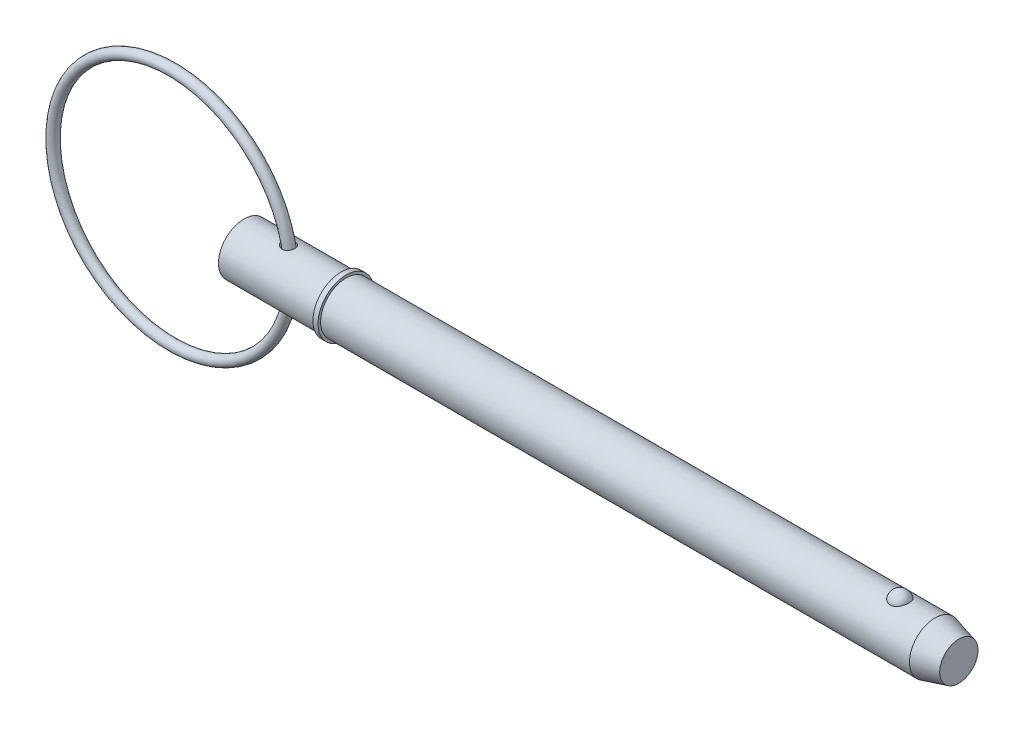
ISO-10303-21;
HEADER;
FILE_DESCRIPTION(('STEP AP214'),'2;1');
FILE_NAME('part.step','',(''),(''),'','','');
FILE_SCHEMA(('AUTOMOTIVE_DESIGN { 1 0 10303 214 1 1 1 1 }'));
ENDSEC;
DATA;
#1=APPLICATION_CONTEXT('core data for automotive mechanical design processes');
#2=APPLICATION_PROTOCOL_DEFINITION('international standard','automotive_design',2000,#1);
#3=PRODUCT_CONTEXT('',#1,'mechanical');
#4=PRODUCT('Part','Part','',(#3));
#5=PRODUCT_RELATED_PRODUCT_CATEGORY('part','',(#4));
#6=PRODUCT_DEFINITION_FORMATION('','',#4);
#7=PRODUCT_DEFINITION_CONTEXT('part definition',#1,'design');
#8=PRODUCT_DEFINITION('design','',#6,#7);
#9=PRODUCT_DEFINITION_SHAPE('','',#8);
#10=(LENGTH_UNIT() NAMED_UNIT(*) SI_UNIT(.MILLI.,.METRE.));
#11=(NAMED_UNIT(*) PLANE_ANGLE_UNIT() SI_UNIT($,.RADIAN.));
#12=(NAMED_UNIT(*) SI_UNIT($,.STERADIAN.) SOLID_ANGLE_UNIT());
#13=UNCERTAINTY_MEASURE_WITH_UNIT(LENGTH_MEASURE(1.E-05),#10,'distance_accuracy_value','');
#14=(GEOMETRIC_REPRESENTATION_CONTEXT(3) GLOBAL_UNCERTAINTY_ASSIGNED_CONTEXT((#13)) GLOBAL_UNIT_ASSIGNED_CONTEXT((#10,
#11,#12)) REPRESENTATION_CONTEXT('',''));
#15=CARTESIAN_POINT('',(0.,0.,0.));
#16=DIRECTION('',(0.,0.,1.));
#17=DIRECTION('',(1.,0.,0.));
#18=AXIS2_PLACEMENT_3D('',#15,#16,#17);
#19=CARTESIAN_POINT('',(-13.4013067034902,0.,0.));
#20=DIRECTION('',(0.,0.,1.));
#21=DIRECTION('',(1.,0.,0.));
#22=AXIS2_PLACEMENT_3D('',#19,#20,#21);
#23=TOROIDAL_SURFACE('',#22,22.225,0.952999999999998);
#24=CARTESIAN_POINT('',(9.77669329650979,0.,0.));
#25=VERTEX_POINT('',#24);
#26=VERTEX_LOOP('',#25);
#27=FACE_BOUND('',#26,.T.);
#28=ADVANCED_FACE('P0_F12',(#27),#23,.T.);
#29=CLOSED_SHELL('',(#28));
#30=MANIFOLD_SOLID_BREP('P0_B1',#29);
#31=CARTESIAN_POINT('',(0.,0.,0.));
#32=DIRECTION('',(1.,0.,0.));
#33=DIRECTION('',(0.,0.,-1.));
#34=AXIS2_PLACEMENT_3D('',#31,#32,#33);
#35=CYLINDRICAL_SURFACE('',#34,4.765);
#36=CARTESIAN_POINT('',(7.31773584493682,4.71580709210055,-0.682926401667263));
#37=CARTESIAN_POINT('',(7.3607471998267,4.70750812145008,-0.740230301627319));
#38=CARTESIAN_POINT('',(7.40883112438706,4.69869300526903,-0.79371122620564));
#39=CARTESIAN_POINT('',(7.51340999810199,4.68106981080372,-0.89180043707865));
#40=CARTESIAN_POINT('',(7.56991882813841,4.67226176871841,-0.936393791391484));
#41=CARTESIAN_POINT('',(7.689548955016,4.65568581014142,-1.01560363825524));
#42=CARTESIAN_POINT('',(7.75265928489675,4.64791621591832,-1.05023633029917));
#43=CARTESIAN_POINT('',(7.88387110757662,4.6343185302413,-1.10870278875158));
#44=CARTESIAN_POINT('',(7.95197058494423,4.62848966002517,-1.13254088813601));
#45=CARTESIAN_POINT('',(8.09209413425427,4.6194749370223,-1.16877415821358));
#46=CARTESIAN_POINT('',(8.16415141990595,4.6163169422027,-1.18104886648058));
#47=CARTESIAN_POINT('',(8.30937958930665,4.61324608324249,-1.19299123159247));
#48=CARTESIAN_POINT('',(8.38255011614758,4.61333220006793,-1.19266284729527));
#49=CARTESIAN_POINT('',(8.52374186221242,4.61674026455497,-1.17939593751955));
#50=CARTESIAN_POINT('',(8.59183022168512,4.61989017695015,-1.16712781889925));
#51=CARTESIAN_POINT('',(8.72470143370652,4.62884731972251,-1.13107903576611));
#52=CARTESIAN_POINT('',(8.78948513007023,4.63465386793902,-1.10730132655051));
#53=CARTESIAN_POINT('',(8.91088768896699,4.64792402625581,-1.05016249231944));
#54=CARTESIAN_POINT('',(8.96774302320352,4.65530108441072,-1.01728198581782));
#55=CARTESIAN_POINT('',(9.07499804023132,4.67102002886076,-0.942471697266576));
#56=CARTESIAN_POINT('',(9.12539777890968,4.6793619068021,-0.900541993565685));
#57=CARTESIAN_POINT('',(9.21836221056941,4.69607497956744,-0.808868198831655));
#58=CARTESIAN_POINT('',(9.26093651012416,4.70444612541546,-0.759133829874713));
#59=CARTESIAN_POINT('',(9.33728390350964,4.72032100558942,-0.653192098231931));
#60=CARTESIAN_POINT('',(9.3710564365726,4.72782468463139,-0.596984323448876));
#61=CARTESIAN_POINT('',(9.42940600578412,4.74126034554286,-0.478808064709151));
#62=CARTESIAN_POINT('',(9.45384681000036,4.74716869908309,-0.416769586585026));
#63=CARTESIAN_POINT('',(9.49226260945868,4.75663465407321,-0.289362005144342));
#64=CARTESIAN_POINT('',(9.50623742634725,4.76019221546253,-0.22399284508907));
#65=CARTESIAN_POINT('',(9.52342004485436,4.76458450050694,-0.0914886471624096));
#66=CARTESIAN_POINT('',(9.52658321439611,4.7654079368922,-0.0243474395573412));
#67=CARTESIAN_POINT('',(9.52194012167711,4.76421136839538,0.109528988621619));
#68=CARTESIAN_POINT('',(9.51413380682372,4.7621913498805,0.176264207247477));
#69=CARTESIAN_POINT('',(9.48775485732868,4.75552896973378,0.307367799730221));
#70=CARTESIAN_POINT('',(9.4691926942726,4.75088915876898,0.371738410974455));
#71=CARTESIAN_POINT('',(9.42175836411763,4.73949008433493,0.496364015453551));
#72=CARTESIAN_POINT('',(9.39288586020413,4.73273075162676,0.556618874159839));
#73=CARTESIAN_POINT('',(9.32549385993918,4.71782154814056,0.671371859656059));
#74=CARTESIAN_POINT('',(9.28696367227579,4.70967013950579,0.725863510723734));
#75=CARTESIAN_POINT('',(9.20123305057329,4.6928883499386,0.827453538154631));
#76=CARTESIAN_POINT('',(9.15403300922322,4.68425799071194,0.874552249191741));
#77=CARTESIAN_POINT('',(9.05250467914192,4.66754854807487,0.959736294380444));
#78=CARTESIAN_POINT('',(8.99822095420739,4.65946646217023,0.997874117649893));
#79=CARTESIAN_POINT('',(8.88381123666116,4.64472049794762,1.06440739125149));
#80=CARTESIAN_POINT('',(8.82368614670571,4.63805640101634,1.09280434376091));
#81=CARTESIAN_POINT('',(8.70022952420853,4.62698068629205,1.13878427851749));
#82=CARTESIAN_POINT('',(8.63695594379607,4.62253830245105,1.15651569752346));
#83=CARTESIAN_POINT('',(8.50825296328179,4.61622454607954,1.18146656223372));
#84=CARTESIAN_POINT('',(8.44282353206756,4.61435321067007,1.18868585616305));
#85=CARTESIAN_POINT('',(8.31119087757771,4.61332122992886,1.19268442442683));
#86=CARTESIAN_POINT('',(8.24498542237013,4.61417920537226,1.18939198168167));
#87=CARTESIAN_POINT('',(8.11397487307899,4.61847671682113,1.17259121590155));
#88=CARTESIAN_POINT('',(8.04917011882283,4.62191687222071,1.15908044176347));
#89=CARTESIAN_POINT('',(7.91946226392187,4.63117528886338,1.12153047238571));
#90=CARTESIAN_POINT('',(7.85470460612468,4.6371000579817,1.09701575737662));
#91=CARTESIAN_POINT('',(7.7300035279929,4.65063246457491,1.03814807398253));
#92=CARTESIAN_POINT('',(7.67006197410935,4.65824075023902,1.00379131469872));
#93=CARTESIAN_POINT('',(7.55352765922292,4.67473656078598,0.924015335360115));
#94=CARTESIAN_POINT('',(7.49726947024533,4.68366994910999,0.878115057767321));
#95=CARTESIAN_POINT('',(7.39344083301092,4.70144936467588,0.777311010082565));
#96=CARTESIAN_POINT('',(7.34587087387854,4.71029538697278,0.722406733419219));
#97=CARTESIAN_POINT('',(7.26188955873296,4.72669773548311,0.605773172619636));
#98=CARTESIAN_POINT('',(7.22531316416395,4.73427229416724,0.544165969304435));
#99=CARTESIAN_POINT('',(7.16406269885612,4.74732663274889,0.415095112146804));
#100=CARTESIAN_POINT('',(7.13937848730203,4.75280819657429,0.347636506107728));
#101=CARTESIAN_POINT('',(7.10494917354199,4.7605495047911,0.215359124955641));
#102=CARTESIAN_POINT('',(7.09405441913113,4.76305589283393,0.150853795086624));
#103=CARTESIAN_POINT('',(7.08387189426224,4.76539656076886,0.0208839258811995));
#104=CARTESIAN_POINT('',(7.0845805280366,4.76523166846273,-0.0445803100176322));
#105=CARTESIAN_POINT('',(7.09709111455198,4.76236014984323,-0.169693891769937));
#106=CARTESIAN_POINT('',(7.10810913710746,4.75983315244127,-0.229428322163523));
#107=CARTESIAN_POINT('',(7.13959099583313,4.75276726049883,-0.346187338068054));
#108=CARTESIAN_POINT('',(7.16004881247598,4.7482296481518,-0.403213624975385));
#109=CARTESIAN_POINT('',(7.20270325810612,4.73907067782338,-0.498040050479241));
#110=CARTESIAN_POINT('',(7.22286864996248,4.73481668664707,-0.536809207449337));
#111=CARTESIAN_POINT('',(7.26730952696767,4.72570777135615,-0.611832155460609));
#112=CARTESIAN_POINT('',(7.29158512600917,4.72085283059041,-0.64808587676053));
#113=CARTESIAN_POINT('',(7.31773584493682,4.71580709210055,-0.682926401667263));
#114=B_SPLINE_CURVE_WITH_KNOTS('',3,(#36,#37,#38,#39,#40,#41,#42,#43,#44,#45,#46,#47,#48,#49,
#50,#51,#52,#53,#54,#55,#56,#57,#58,#59,#60,#61,#62,#63,#64,#65,#66,#67,#68,#69,#70,#71,#72,#73,
#74,#75,#76,#77,#78,#79,#80,#81,#82,#83,#84,#85,#86,#87,#88,#89,#90,#91,#92,#93,#94,#95,#96,#97,
#98,#99,#100,#101,#102,#103,#104,#105,#106,#107,#108,#109,#110,#111,#112,#113),.UNSPECIFIED.,
.T.,.F.,(4,2,2,2,2,2,2,2,2,2,2,2,2,2,2,2,2,2,2,2,2,2,2,2,2,2,2,2,2,2,2,2,2,2,2,2,2,2,4),(0.,
0.216219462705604,0.432799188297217,0.649024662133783,0.865163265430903,1.08352938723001,
1.30182691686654,1.50853487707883,1.71518978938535,1.91252381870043,2.1098561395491,
2.30694457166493,2.50404555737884,2.70392296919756,2.90380378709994,3.10450875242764,
3.30521468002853,3.5057255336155,3.70624293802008,3.90698330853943,4.10771458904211,
4.30723900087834,4.50673262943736,4.70338139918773,4.90003300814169,5.09802914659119,
5.29607279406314,5.5036500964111,5.7113074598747,5.92972727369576,6.14815938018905,
6.36312650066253,6.57790998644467,6.77325899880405,6.96854747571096,7.15009726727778,
7.33153144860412,7.46298830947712,7.59444881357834),.UNSPECIFIED.);
#115=CARTESIAN_POINT('',(7.31773584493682,4.71580709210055,-0.682926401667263));
#116=VERTEX_POINT('',#115);
#117=EDGE_CURVE('P1_E42',#116,#116,#114,.T.);
#118=ORIENTED_EDGE('',*,*,#117,.T.);
#119=EDGE_LOOP('',(#118));
#120=FACE_BOUND('',#119,.T.);
#121=CARTESIAN_POINT('',(0.,0.,0.));
#122=DIRECTION('',(1.,0.,0.));
#123=DIRECTION('',(0.,0.,-1.));
#124=AXIS2_PLACEMENT_3D('',#121,#122,#123);
#125=CIRCLE('',#124,4.765);
#126=CARTESIAN_POINT('',(0.,0.,-4.765));
#127=VERTEX_POINT('',#126);
#128=EDGE_CURVE('P1_E9',#127,#127,#125,.T.);
#129=ORIENTED_EDGE('',*,*,#128,.T.);
#130=EDGE_LOOP('',(#129));
#131=FACE_BOUND('',#130,.T.);
#132=CARTESIAN_POINT('',(18.097,0.,0.));
#133=DIRECTION('',(1.,0.,0.));
#134=DIRECTION('',(0.,0.,-1.));
#135=AXIS2_PLACEMENT_3D('',#132,#133,#134);
#136=CIRCLE('',#135,4.765);
#137=CARTESIAN_POINT('',(18.097,0.,-4.765));
#138=VERTEX_POINT('',#137);
#139=EDGE_CURVE('P1_E25',#138,#138,#136,.T.);
#140=ORIENTED_EDGE('',*,*,#139,.F.);
#141=EDGE_LOOP('',(#140));
#142=FACE_BOUND('',#141,.T.);
#143=CARTESIAN_POINT('',(7.31773584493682,-4.71580709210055,-0.682926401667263));
#144=CARTESIAN_POINT('',(7.27956054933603,-4.72317282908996,-0.63206220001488));
#145=CARTESIAN_POINT('',(7.24535712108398,-4.7301361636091,-0.578155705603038));
#146=CARTESIAN_POINT('',(7.18611785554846,-4.74256090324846,-0.465352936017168));
#147=CARTESIAN_POINT('',(7.16107836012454,-4.74802290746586,-0.406458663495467));
#148=CARTESIAN_POINT('',(7.12119149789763,-4.75686558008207,-0.284913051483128));
#149=CARTESIAN_POINT('',(7.1063796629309,-4.76023898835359,-0.222249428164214));
#150=CARTESIAN_POINT('',(7.08786546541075,-4.76447177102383,-0.0952170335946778));
#151=CARTESIAN_POINT('',(7.08416018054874,-4.76533180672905,-0.0308487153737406));
#152=CARTESIAN_POINT('',(7.08795686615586,-4.76445764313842,0.0942755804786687));
#153=CARTESIAN_POINT('',(7.09490366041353,-4.762851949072,0.155050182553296));
#154=CARTESIAN_POINT('',(7.11863973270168,-4.75746086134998,0.2745356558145));
#155=CARTESIAN_POINT('',(7.13542953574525,-4.75367535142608,0.333246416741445));
#156=CARTESIAN_POINT('',(7.17817193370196,-4.74430545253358,0.447305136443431));
#157=CARTESIAN_POINT('',(7.20415836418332,-4.73871442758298,0.502639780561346));
#158=CARTESIAN_POINT('',(7.26428068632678,-4.72628508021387,0.608523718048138));
#159=CARTESIAN_POINT('',(7.29841897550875,-4.71944639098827,0.659071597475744));
#160=CARTESIAN_POINT('',(7.37680984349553,-4.70456239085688,0.758311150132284));
#161=CARTESIAN_POINT('',(7.42165519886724,-4.69646426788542,0.806526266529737));
#162=CARTESIAN_POINT('',(7.51828933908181,-4.68032890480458,0.895428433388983));
#163=CARTESIAN_POINT('',(7.57008134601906,-4.67229169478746,0.936111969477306));
#164=CARTESIAN_POINT('',(7.68397204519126,-4.65640659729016,1.01229731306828));
#165=CARTESIAN_POINT('',(7.74657226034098,-4.64863251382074,1.04706751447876));
#166=CARTESIAN_POINT('',(7.87680110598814,-4.6349740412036,1.10596507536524));
#167=CARTESIAN_POINT('',(7.94443054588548,-4.62908995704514,1.13009071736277));
#168=CARTESIAN_POINT('',(8.08402017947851,-4.61989019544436,1.16713943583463));
#169=CARTESIAN_POINT('',(8.15603143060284,-4.61661596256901,1.17988211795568));
#170=CARTESIAN_POINT('',(8.30124697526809,-4.61330446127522,1.1927680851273));
#171=CARTESIAN_POINT('',(8.37445077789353,-4.61326589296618,1.19291642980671));
#172=CARTESIAN_POINT('',(8.51584800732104,-4.61644036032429,1.18056687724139));
#173=CARTESIAN_POINT('',(8.58410302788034,-4.61948317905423,1.16873099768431));
#174=CARTESIAN_POINT('',(8.71738052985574,-4.6282520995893,1.13350536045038));
#175=CARTESIAN_POINT('',(8.78240382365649,-4.63397752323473,1.11011852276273));
#176=CARTESIAN_POINT('',(8.90428519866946,-4.64711877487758,1.05371003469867));
#177=CARTESIAN_POINT('',(8.96138096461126,-4.6544450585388,1.02117932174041));
#178=CARTESIAN_POINT('',(9.06916653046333,-4.6700970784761,0.947021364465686));
#179=CARTESIAN_POINT('',(9.11985639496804,-4.67842280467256,0.905394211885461));
#180=CARTESIAN_POINT('',(9.2134071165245,-4.69513303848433,0.814300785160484));
#181=CARTESIAN_POINT('',(9.25628268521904,-4.70351740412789,0.764849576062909));
#182=CARTESIAN_POINT('',(9.33327173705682,-4.71945185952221,0.659422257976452));
#183=CARTESIAN_POINT('',(9.3673846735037,-4.72700189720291,0.603445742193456));
#184=CARTESIAN_POINT('',(9.42645214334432,-4.74055953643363,0.485673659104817));
#185=CARTESIAN_POINT('',(9.45127042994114,-4.74654383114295,0.423807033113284));
#186=CARTESIAN_POINT('',(9.49046298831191,-4.756182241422,0.296676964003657));
#187=CARTESIAN_POINT('',(9.50483706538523,-4.75983631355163,0.231413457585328));
#188=CARTESIAN_POINT('',(9.52283408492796,-4.76443282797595,0.0990368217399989));
#189=CARTESIAN_POINT('',(9.52641016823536,-4.76536345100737,0.0319169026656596));
#190=CARTESIAN_POINT('',(9.52259067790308,-4.76437893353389,-0.101988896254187));
#191=CARTESIAN_POINT('',(9.5151950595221,-4.76246378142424,-0.168774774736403));
#192=CARTESIAN_POINT('',(9.48962516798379,-4.75599746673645,-0.300048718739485));
#193=CARTESIAN_POINT('',(9.4714615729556,-4.75144891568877,-0.364538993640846));
#194=CARTESIAN_POINT('',(9.42480303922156,-4.74020887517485,-0.489470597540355));
#195=CARTESIAN_POINT('',(9.396307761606,-4.73351731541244,-0.549911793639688));
#196=CARTESIAN_POINT('',(9.32963953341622,-4.71871240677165,-0.665099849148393));
#197=CARTESIAN_POINT('',(9.29145577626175,-4.71059747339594,-0.719840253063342));
#198=CARTESIAN_POINT('',(9.20637695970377,-4.69385254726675,-0.82198328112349));
#199=CARTESIAN_POINT('',(9.15948227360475,-4.68522257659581,-0.869386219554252));
#200=CARTESIAN_POINT('',(9.05849937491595,-4.66847516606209,-0.955233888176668));
#201=CARTESIAN_POINT('',(9.00445430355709,-4.6603550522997,-0.993728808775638));
#202=CARTESIAN_POINT('',(8.8904576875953,-4.64550122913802,-1.06100691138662));
#203=CARTESIAN_POINT('',(8.83050704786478,-4.63876730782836,-1.08979157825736));
#204=CARTESIAN_POINT('',(8.70732873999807,-4.6275305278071,-1.13655620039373));
#205=CARTESIAN_POINT('',(8.64416019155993,-4.62299714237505,-1.15468477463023));
#206=CARTESIAN_POINT('',(8.51559711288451,-4.61649071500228,-1.18043067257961));
#207=CARTESIAN_POINT('',(8.4502025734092,-4.61451768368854,-1.18804795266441));
#208=CARTESIAN_POINT('',(8.31862013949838,-4.61328355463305,-1.19283094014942));
#209=CARTESIAN_POINT('',(8.25242983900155,-4.61403911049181,-1.18993246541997));
#210=CARTESIAN_POINT('',(8.12138461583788,-4.61814057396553,-1.17391149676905));
#211=CARTESIAN_POINT('',(8.0565300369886,-4.62148714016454,-1.16078640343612));
#212=CARTESIAN_POINT('',(7.92669960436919,-4.63056912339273,-1.12402333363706));
#213=CARTESIAN_POINT('',(7.86186447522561,-4.63641051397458,-1.09991536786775));
#214=CARTESIAN_POINT('',(7.73694230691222,-4.64980121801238,-1.04185298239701));
#215=CARTESIAN_POINT('',(7.6768568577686,-4.65735110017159,-1.0078952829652));
#216=CARTESIAN_POINT('',(7.56207884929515,-4.67346080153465,-0.930364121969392));
#217=CARTESIAN_POINT('',(7.5074784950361,-4.68203382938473,-0.886656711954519));
#218=CARTESIAN_POINT('',(7.40624045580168,-4.69916824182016,-0.79082583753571));
#219=CARTESIAN_POINT('',(7.35959988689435,-4.7077296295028,-0.738705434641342));
#220=CARTESIAN_POINT('',(7.31773584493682,-4.71580709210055,-0.682926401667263));
#221=B_SPLINE_CURVE_WITH_KNOTS('',3,(#143,#144,#145,#146,#147,#148,#149,#150,#151,#152,#153,
#154,#155,#156,#157,#158,#159,#160,#161,#162,#163,#164,#165,#166,#167,#168,#169,#170,#171,#172,
#173,#174,#175,#176,#177,#178,#179,#180,#181,#182,#183,#184,#185,#186,#187,#188,#189,#190,#191,
#192,#193,#194,#195,#196,#197,#198,#199,#200,#201,#202,#203,#204,#205,#206,#207,#208,#209,#210,
#211,#212,#213,#214,#215,#216,#217,#218,#219,#220),.UNSPECIFIED.,.T.,.F.,(4,2,2,2,2,2,2,2,2,2,2,
2,2,2,2,2,2,2,2,2,2,2,2,2,2,2,2,2,2,2,2,2,2,2,2,2,2,2,4),(0.,0.191851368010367,0.38362606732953,
0.576063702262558,0.768450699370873,0.951145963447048,1.13385097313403,1.31723528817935,
1.50067360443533,1.69887079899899,1.8971602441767,2.11225870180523,2.32739185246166,
2.54587681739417,2.76427400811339,2.97123130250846,3.17813630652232,3.37555441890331,
3.57297054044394,3.77001106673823,3.96706388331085,4.16690159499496,4.36674303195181,
4.56745046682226,4.76815872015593,4.96866827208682,5.16918440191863,5.36992517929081,
5.5706573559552,5.77022940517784,5.96977092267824,6.16645904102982,6.36314797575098,
6.56103940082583,6.75898114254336,6.96633026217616,7.17374850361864,7.384214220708,
7.59460352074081),.UNSPECIFIED.);
#222=CARTESIAN_POINT('',(7.31773584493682,-4.71580709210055,-0.682926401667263));
#223=VERTEX_POINT('',#222);
#224=EDGE_CURVE('P1_E17',#223,#223,#221,.T.);
#225=ORIENTED_EDGE('',*,*,#224,.T.);
#226=EDGE_LOOP('',(#225));
#227=FACE_BOUND('',#226,.T.);
#228=ADVANCED_FACE('P1_F13',(#120,#131,#142,#227),#35,.T.);
#229=CARTESIAN_POINT('',(0.,0.,0.));
#230=DIRECTION('',(1.,0.,0.));
#231=DIRECTION('',(0.,0.,-1.));
#232=AXIS2_PLACEMENT_3D('',#229,#230,#231);
#233=CYLINDRICAL_SURFACE('',#232,4.765);
#234=CARTESIAN_POINT('',(128.904194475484,0.,0.));
#235=DIRECTION('',(1.,0.,0.));
#236=DIRECTION('',(0.,0.,-1.));
#237=AXIS2_PLACEMENT_3D('',#234,#235,#236);
#238=CIRCLE('',#237,4.765);
#239=CARTESIAN_POINT('',(128.904194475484,0.,-4.765));
#240=VERTEX_POINT('',#239);
#241=EDGE_CURVE('P1_E99',#240,#240,#238,.T.);
#242=ORIENTED_EDGE('',*,*,#241,.F.);
#243=EDGE_LOOP('',(#242));
#244=FACE_BOUND('',#243,.T.);
#245=CARTESIAN_POINT('',(19.05,0.,0.));
#246=DIRECTION('',(1.,0.,0.));
#247=DIRECTION('',(0.,0.,-1.));
#248=AXIS2_PLACEMENT_3D('',#245,#246,#247);
#249=CIRCLE('',#248,4.765);
#250=CARTESIAN_POINT('',(19.05,0.,-4.765));
#251=VERTEX_POINT('',#250);
#252=EDGE_CURVE('P1_E96',#251,#251,#249,.T.);
#253=ORIENTED_EDGE('',*,*,#252,.T.);
#254=EDGE_LOOP('',(#253));
#255=FACE_BOUND('',#254,.T.);
#256=CARTESIAN_POINT('',(122.351020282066,4.42764777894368,1.76101111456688));
#257=CARTESIAN_POINT('',(122.259721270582,4.42764470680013,1.76101422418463));
#258=CARTESIAN_POINT('',(122.168446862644,4.43059091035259,1.75366340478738));
#259=CARTESIAN_POINT('',(121.988615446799,4.44201846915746,1.72451180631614));
#260=CARTESIAN_POINT('',(121.900057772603,4.45049845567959,1.70271460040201));
#261=CARTESIAN_POINT('',(121.728257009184,4.47200516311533,1.6453937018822));
#262=CARTESIAN_POINT('',(121.645006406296,4.48502527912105,1.60988994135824));
#263=CARTESIAN_POINT('',(121.485763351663,4.51419542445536,1.52617873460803));
#264=CARTESIAN_POINT('',(121.409772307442,4.53034605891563,1.47796883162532));
#265=CARTESIAN_POINT('',(121.264744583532,4.5645931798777,1.36860494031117));
#266=CARTESIAN_POINT('',(121.195964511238,4.58273170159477,1.30712420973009));
#267=CARTESIAN_POINT('',(121.069342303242,4.61870302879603,1.17370204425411));
#268=CARTESIAN_POINT('',(121.011502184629,4.63653577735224,1.10175868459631));
#269=CARTESIAN_POINT('',(120.905570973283,4.67090140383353,0.945806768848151));
#270=CARTESIAN_POINT('',(120.858030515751,4.68734068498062,0.861402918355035));
#271=CARTESIAN_POINT('',(120.777081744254,4.71628466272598,0.685442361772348));
#272=CARTESIAN_POINT('',(120.743674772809,4.72878898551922,0.593884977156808));
#273=CARTESIAN_POINT('',(120.691287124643,4.74874061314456,0.40478128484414));
#274=CARTESIAN_POINT('',(120.672517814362,4.75611366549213,0.307168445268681));
#275=CARTESIAN_POINT('',(120.650584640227,4.76475393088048,0.109940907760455));
#276=CARTESIAN_POINT('',(120.647420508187,4.76602124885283,0.0103262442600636));
#277=CARTESIAN_POINT('',(120.656740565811,4.76232928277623,-0.187629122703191));
#278=CARTESIAN_POINT('',(120.669158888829,4.7573962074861,-0.285973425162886));
#279=CARTESIAN_POINT('',(120.709280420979,4.74184975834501,-0.47902728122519));
#280=CARTESIAN_POINT('',(120.736983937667,4.7312362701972,-0.573736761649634));
#281=CARTESIAN_POINT('',(120.807158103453,4.70540026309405,-0.756973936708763));
#282=CARTESIAN_POINT('',(120.849646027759,4.69017235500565,-0.845494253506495));
#283=CARTESIAN_POINT('',(120.948520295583,4.6566986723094,-1.01378033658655));
#284=CARTESIAN_POINT('',(121.004907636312,4.63845268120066,-1.09354547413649));
#285=CARTESIAN_POINT('',(121.130552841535,4.60085438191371,-1.24228523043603));
#286=CARTESIAN_POINT('',(121.199843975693,4.58149930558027,-1.31123108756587));
#287=CARTESIAN_POINT('',(121.349606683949,4.54391653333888,-1.43607409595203));
#288=CARTESIAN_POINT('',(121.430077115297,4.52568872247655,-1.49197257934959));
#289=CARTESIAN_POINT('',(121.598150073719,4.49293007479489,-1.58786764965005));
#290=CARTESIAN_POINT('',(121.685544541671,4.47832346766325,-1.62820219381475));
#291=CARTESIAN_POINT('',(121.866553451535,4.45406011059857,-1.69345757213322));
#292=CARTESIAN_POINT('',(121.96016555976,4.44440151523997,-1.71838415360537));
#293=CARTESIAN_POINT('',(122.145893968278,4.43159888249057,-1.75112843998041));
#294=CARTESIAN_POINT('',(122.237849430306,4.42815213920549,-1.75974223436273));
#295=CARTESIAN_POINT('',(122.421965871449,4.427247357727,-1.76201865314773));
#296=CARTESIAN_POINT('',(122.514126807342,4.42978816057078,-1.7556841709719));
#297=CARTESIAN_POINT('',(122.693129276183,4.4403864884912,-1.72869560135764));
#298=CARTESIAN_POINT('',(122.780047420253,4.44827555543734,-1.70847853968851));
#299=CARTESIAN_POINT('',(122.949131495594,4.46852246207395,-1.65479562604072));
#300=CARTESIAN_POINT('',(123.031297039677,4.48088066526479,-1.62132869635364));
#301=CARTESIAN_POINT('',(123.190591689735,4.50907357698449,-1.54120560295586));
#302=CARTESIAN_POINT('',(123.267570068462,4.52497884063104,-1.49427526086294));
#303=CARTESIAN_POINT('',(123.412708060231,4.55845148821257,-1.38881222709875));
#304=CARTESIAN_POINT('',(123.480865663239,4.57601924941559,-1.33027689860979));
#305=CARTESIAN_POINT('',(123.610099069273,4.61196537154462,-1.19991049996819));
#306=CARTESIAN_POINT('',(123.670656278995,4.63034074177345,-1.12756415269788));
#307=CARTESIAN_POINT('',(123.779279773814,4.66513959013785,-0.973612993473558));
#308=CARTESIAN_POINT('',(123.827343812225,4.68156271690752,-0.892006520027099));
#309=CARTESIAN_POINT('',(123.911383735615,4.71130224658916,-0.71889227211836));
#310=CARTESIAN_POINT('',(123.946918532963,4.724501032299,-0.627149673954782));
#311=CARTESIAN_POINT('',(124.002952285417,4.74571823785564,-0.438611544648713));
#312=CARTESIAN_POINT('',(124.023450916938,4.75373654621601,-0.341815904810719));
#313=CARTESIAN_POINT('',(124.049033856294,4.76378905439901,-0.145633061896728));
#314=CARTESIAN_POINT('',(124.054076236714,4.76580697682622,-0.0462395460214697));
#315=CARTESIAN_POINT('',(124.048523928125,4.7636057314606,0.152038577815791));
#316=CARTESIAN_POINT('',(124.037929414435,4.75938663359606,0.250923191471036));
#317=CARTESIAN_POINT('',(124.001387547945,4.74516937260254,0.445004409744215));
#318=CARTESIAN_POINT('',(123.975496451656,4.73519238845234,0.540213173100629));
#319=CARTESIAN_POINT('',(123.908927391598,4.71049394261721,0.724662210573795));
#320=CARTESIAN_POINT('',(123.868248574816,4.69577220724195,0.81390214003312));
#321=CARTESIAN_POINT('',(123.772717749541,4.66303767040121,0.984313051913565));
#322=CARTESIAN_POINT('',(123.717804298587,4.64501070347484,1.06544688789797));
#323=CARTESIAN_POINT('',(123.595049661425,4.60764678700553,1.21692673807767));
#324=CARTESIAN_POINT('',(123.527208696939,4.58830985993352,1.2872729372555));
#325=CARTESIAN_POINT('',(123.380548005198,4.55060370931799,1.41479271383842));
#326=CARTESIAN_POINT('',(123.301791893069,4.53222967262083,1.47203785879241));
#327=CARTESIAN_POINT('',(123.134989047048,4.49849576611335,1.57212016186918));
#328=CARTESIAN_POINT('',(123.046941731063,4.48313608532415,1.61495641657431));
#329=CARTESIAN_POINT('',(122.859791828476,4.45676184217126,1.68642657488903));
#330=CARTESIAN_POINT('',(122.760365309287,4.44598302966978,1.71430590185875));
#331=CARTESIAN_POINT('',(122.557621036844,4.43142918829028,1.75159258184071));
#332=CARTESIAN_POINT('',(122.454304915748,4.42765125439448,1.76100759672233));
#333=CARTESIAN_POINT('',(122.351020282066,4.42764777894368,1.76101111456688));
#334=B_SPLINE_CURVE_WITH_KNOTS('',3,(#256,#257,#258,#259,#260,#261,#262,#263,#264,#265,#266,
#267,#268,#269,#270,#271,#272,#273,#274,#275,#276,#277,#278,#279,#280,#281,#282,#283,#284,#285,
#286,#287,#288,#289,#290,#291,#292,#293,#294,#295,#296,#297,#298,#299,#300,#301,#302,#303,#304,
#305,#306,#307,#308,#309,#310,#311,#312,#313,#314,#315,#316,#317,#318,#319,#320,#321,#322,#323,
#324,#325,#326,#327,#328,#329,#330,#331,#332,#333),.UNSPECIFIED.,.T.,.F.,(4,2,2,2,2,2,2,2,2,2,2,
2,2,2,2,2,2,2,2,2,2,2,2,2,2,2,2,2,2,2,2,2,2,2,2,2,2,2,4),(0.,0.273517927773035,
0.546968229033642,0.820022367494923,1.09312934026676,1.37393946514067,1.65480131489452,
1.94820420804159,2.24163496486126,2.53922817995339,2.8368162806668,3.13315071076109,
3.42949110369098,3.72617893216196,4.02288805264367,4.32037303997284,4.61782764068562,
4.90840095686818,5.19886582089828,5.4747485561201,5.75057789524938,6.01809977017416,
6.2856434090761,6.55907787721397,6.83257454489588,7.11962987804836,7.40673679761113,
7.70312663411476,7.99952284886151,8.29672237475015,8.59391856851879,8.89002850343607,
9.18615552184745,9.483582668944,9.78100471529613,10.0767610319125,10.3725358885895,
10.6820893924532,10.991514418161),.UNSPECIFIED.);
#335=CARTESIAN_POINT('',(122.351020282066,4.42764777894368,1.76101111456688));
#336=VERTEX_POINT('',#335);
#337=EDGE_CURVE('P1_E34',#336,#336,#334,.T.);
#338=ORIENTED_EDGE('',*,*,#337,.T.);
#339=EDGE_LOOP('',(#338));
#340=FACE_BOUND('',#339,.T.);
#341=ADVANCED_FACE('P1_F46',(#244,#255,#340),#233,.T.);
#342=CARTESIAN_POINT('',(0.,0.,0.));
#343=DIRECTION('',(-1.,0.,0.));
#344=DIRECTION('',(0.,0.,1.));
#345=AXIS2_PLACEMENT_3D('',#342,#343,#344);
#346=PLANE('',#345);
#347=ORIENTED_EDGE('',*,*,#128,.F.);
#348=EDGE_LOOP('',(#347));
#349=FACE_BOUND('',#348,.T.);
#350=ADVANCED_FACE('P1_F15',(#349),#346,.T.);
#351=CARTESIAN_POINT('',(18.097,4.765,0.));
#352=DIRECTION('',(-1.,0.,0.));
#353=DIRECTION('',(0.,0.,1.));
#354=AXIS2_PLACEMENT_3D('',#351,#352,#353);
#355=PLANE('',#354);
#356=ORIENTED_EDGE('',*,*,#139,.T.);
#357=EDGE_LOOP('',(#356));
#358=FACE_BOUND('',#357,.T.);
#359=CARTESIAN_POINT('',(18.097,0.,0.));
#360=DIRECTION('',(1.,0.,0.));
#361=DIRECTION('',(0.,0.,-1.));
#362=AXIS2_PLACEMENT_3D('',#359,#360,#361);
#363=CIRCLE('',#362,5.2415);
#364=CARTESIAN_POINT('',(18.097,0.,-5.2415));
#365=VERTEX_POINT('',#364);
#366=EDGE_CURVE('P1_E30',#365,#365,#363,.T.);
#367=ORIENTED_EDGE('',*,*,#366,.F.);
#368=EDGE_LOOP('',(#367));
#369=FACE_BOUND('',#368,.T.);
#370=ADVANCED_FACE('P1_F81',(#358,#369),#355,.T.);
#371=CARTESIAN_POINT('',(0.,0.,0.));
#372=DIRECTION('',(1.,0.,0.));
#373=DIRECTION('',(0.,0.,-1.));
#374=AXIS2_PLACEMENT_3D('',#371,#372,#373);
#375=CYLINDRICAL_SURFACE('',#374,5.2415);
#376=ORIENTED_EDGE('',*,*,#366,.T.);
#377=EDGE_LOOP('',(#376));
#378=FACE_BOUND('',#377,.T.);
#379=CARTESIAN_POINT('',(19.05,0.,0.));
#380=DIRECTION('',(1.,0.,0.));
#381=DIRECTION('',(0.,0.,-1.));
#382=AXIS2_PLACEMENT_3D('',#379,#380,#381);
#383=CIRCLE('',#382,5.2415);
#384=CARTESIAN_POINT('',(19.05,0.,-5.2415));
#385=VERTEX_POINT('',#384);
#386=EDGE_CURVE('P1_E95',#385,#385,#383,.T.);
#387=ORIENTED_EDGE('',*,*,#386,.F.);
#388=EDGE_LOOP('',(#387));
#389=FACE_BOUND('',#388,.T.);
#390=ADVANCED_FACE('P1_F68',(#378,#389),#375,.T.);
#391=CARTESIAN_POINT('',(19.05,5.2415,0.));
#392=DIRECTION('',(1.,0.,0.));
#393=DIRECTION('',(0.,0.,-1.));
#394=AXIS2_PLACEMENT_3D('',#391,#392,#393);
#395=PLANE('',#394);
#396=ORIENTED_EDGE('',*,*,#386,.T.);
#397=EDGE_LOOP('',(#396));
#398=FACE_BOUND('',#397,.T.);
#399=ORIENTED_EDGE('',*,*,#252,.F.);
#400=EDGE_LOOP('',(#399));
#401=FACE_BOUND('',#400,.T.);
#402=ADVANCED_FACE('P1_F62',(#398,#401),#395,.T.);
#403=CARTESIAN_POINT('',(133.35,0.,0.));
#404=DIRECTION('',(-1.,0.,0.));
#405=DIRECTION('',(0.,0.,1.));
#406=AXIS2_PLACEMENT_3D('',#403,#404,#405);
#407=CONICAL_SURFACE('',#406,3.57375000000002,0.261799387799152);
#408=ORIENTED_EDGE('',*,*,#241,.T.);
#409=EDGE_LOOP('',(#408));
#410=FACE_BOUND('',#409,.T.);
#411=CARTESIAN_POINT('',(133.35,0.,0.));
#412=DIRECTION('',(1.,0.,0.));
#413=DIRECTION('',(0.,0.,-1.));
#414=AXIS2_PLACEMENT_3D('',#411,#412,#413);
#415=CIRCLE('',#414,3.57375000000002);
#416=CARTESIAN_POINT('',(133.35,0.,-3.57375000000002));
#417=VERTEX_POINT('',#416);
#418=EDGE_CURVE('P1_E41',#417,#417,#415,.T.);
#419=ORIENTED_EDGE('',*,*,#418,.F.);
#420=EDGE_LOOP('',(#419));
#421=FACE_BOUND('',#420,.T.);
#422=ADVANCED_FACE('P1_F59',(#410,#421),#407,.T.);
#423=CARTESIAN_POINT('',(133.35,3.57375000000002,0.));
#424=DIRECTION('',(1.,0.,0.));
#425=DIRECTION('',(0.,0.,-1.));
#426=AXIS2_PLACEMENT_3D('',#423,#424,#425);
#427=PLANE('',#426);
#428=ORIENTED_EDGE('',*,*,#418,.T.);
#429=EDGE_LOOP('',(#428));
#430=FACE_BOUND('',#429,.T.);
#431=ADVANCED_FACE('P1_F55',(#430),#427,.T.);
#432=CARTESIAN_POINT('',(122.351020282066,4.2885,0.));
#433=DIRECTION('',(-1.,0.,0.));
#434=DIRECTION('',(0.,-1.,0.));
#435=AXIS2_PLACEMENT_3D('',#432,#433,#434);
#436=SPHERICAL_SURFACE('',#435,1.7665);
#437=ORIENTED_EDGE('',*,*,#337,.F.);
#438=EDGE_LOOP('',(#437));
#439=FACE_BOUND('',#438,.T.);
#440=ADVANCED_FACE('P1_F50',(#439),#436,.T.);
#441=CARTESIAN_POINT('',(-13.4013067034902,0.,0.));
#442=DIRECTION('',(0.,0.,1.));
#443=DIRECTION('',(1.,0.,0.));
#444=AXIS2_PLACEMENT_3D('',#441,#442,#443);
#445=TOROIDAL_SURFACE('',#444,22.225,1.19125);
#446=ORIENTED_EDGE('',*,*,#224,.F.);
#447=EDGE_LOOP('',(#446));
#448=FACE_BOUND('',#447,.T.);
#449=ORIENTED_EDGE('',*,*,#117,.F.);
#450=EDGE_LOOP('',(#449));
#451=FACE_BOUND('',#450,.T.);
#452=ADVANCED_FACE('P1_F54',(#448,#451),#445,.F.);
#453=CLOSED_SHELL('',(#228,#341,#350,#370,#390,#402,#422,#431,#440,#452));
#454=MANIFOLD_SOLID_BREP('P1_B1',#453);
#455=ADVANCED_BREP_SHAPE_REPRESENTATION('',(#18,#30,#454),#14);
#456=SHAPE_DEFINITION_REPRESENTATION(#9,#455);
ENDSEC;
END-ISO-10303-21;
